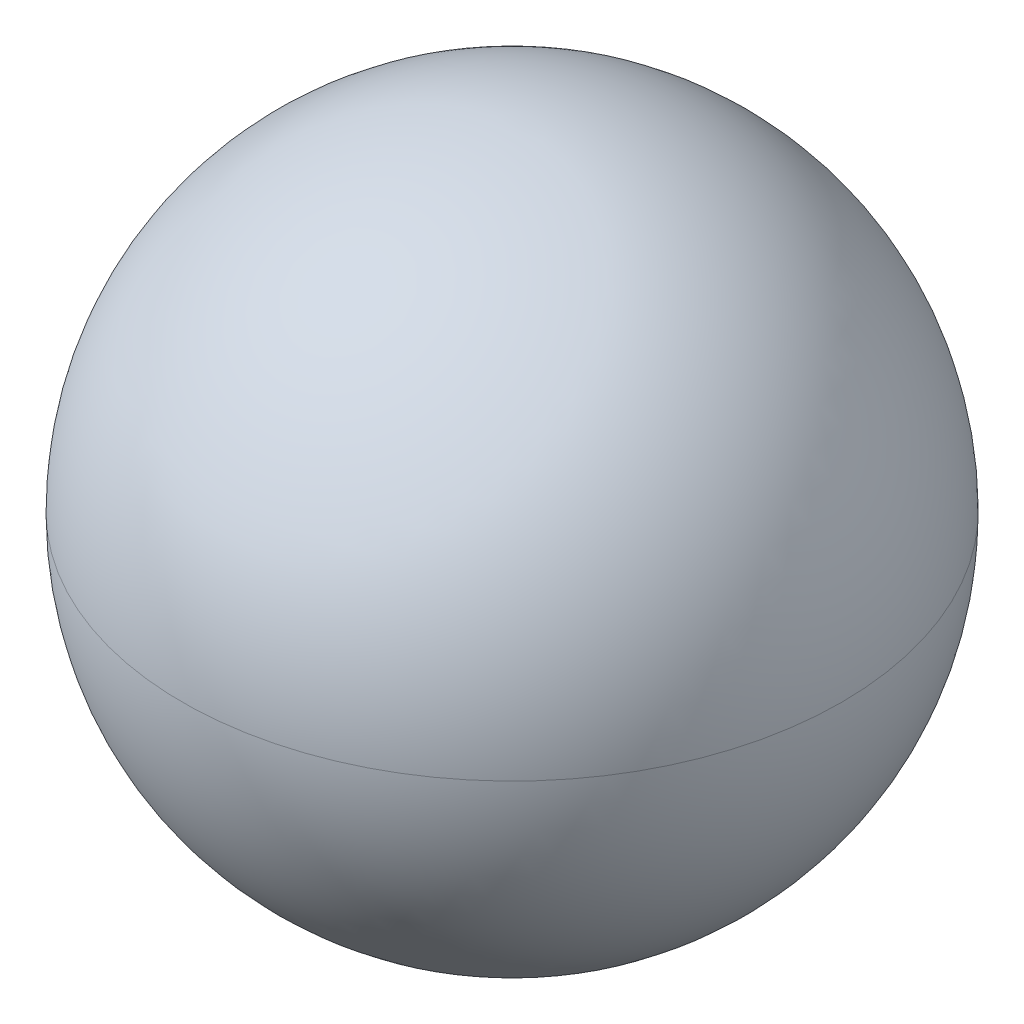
from build123d import *

# Parameters (mm, degrees)
CUT_EXTRUDE1_REACH      = 5.464
CUT_EXTRUDE1_END_RADIUS = 2
SKETCH2_R               = 0.75
SKETCH5_R               = 0.5
CUT_EXTRUDE2_DEPTH      = 1


with BuildPart() as part:
    # Sketch1 → Revolve1 (revolve)
    with BuildSketch(Plane.XY):
        with BuildLine():
            Line((0, 2), (0, -2))
            ThreePointArc((0, -2), (-2, 0), (0, 2))
        make_face()
    revolve(axis=Axis((0, 2, 0), (0, -1, 0)))

    # Cut-Extrude1: up to this sphere (the profile starts inside it)
    cut_extrude1_end = Location((0, 0, 0)) * Sphere(CUT_EXTRUDE1_END_RADIUS, mode=Mode.PRIVATE)
    # Sketch2 → Cut-Extrude1 (cut, up to the surface)
    with BuildSketch(Plane.XY, mode=Mode.PRIVATE) as cut_extrude1_sk1:
        Circle(SKETCH2_R)
    cut_extrude1_tool1 = extrude(cut_extrude1_sk1.sketch, amount=-CUT_EXTRUDE1_REACH, mode=Mode.PRIVATE) & cut_extrude1_end
    add(cut_extrude1_tool1.solids().sort_by_distance((0, 0, 0))[0], mode=Mode.SUBTRACT)

    # Sketch5 → Cut-Extrude2 (cut)
    with BuildSketch(Plane(origin=(0, 0, 0), x_dir=(-1, 0, 0), z_dir=(0, 0, -1))):
        Circle(SKETCH5_R)
    extrude(amount=-CUT_EXTRUDE2_DEPTH, mode=Mode.SUBTRACT)


solid = part.part
